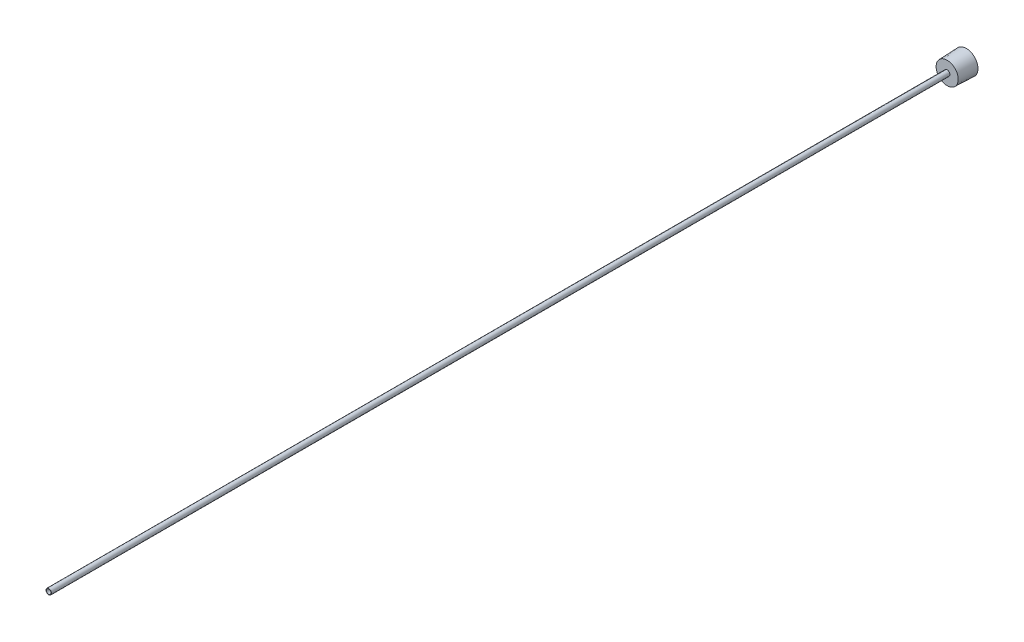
from build123d import *

# Parameters (mm, degrees)
SKETCH2_R          = 0.762
CUT_EXTRUDE1_DEPTH = 305.84986935
CUT_EXTRUDE2_DEPTH = 3.96875


with BuildPart() as part:
    # Sketch1 → Revolve1 (revolve)
    with BuildSketch(Plane(origin=(0, 0, 0), x_dir=(0, 0, -1), z_dir=(1, 0, 0)), mode=Mode.PRIVATE) as revolve1_sk:
        Polygon((-304.8, 0), (0, 0), (0, 3.8989), (-6.35, 3.667387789), (-6.35, 0.9144), (-304.8, 0.9144), align=None)
    revolve(revolve1_sk.sketch.rotate(Axis((0, 0, 0), (0, 0, -1)), 90), axis=Axis((0, 0, 0), (0, 0, -1)))

    # Sketch2 → Cut-Extrude1 (cut, through all)
    with BuildSketch(Plane.XY.offset(304.8)):
        Circle(SKETCH2_R)
    extrude(amount=-CUT_EXTRUDE1_DEPTH, mode=Mode.SUBTRACT)

    # Sketch3 → Cut-Extrude2 (cut)
    with BuildSketch(Plane(origin=(0, 0, 0), x_dir=(-1, 0, 0), z_dir=(0, 0, -1))):
        Polygon((0, -2.749630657), (2.38125, -1.374815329), (2.38125, 1.374815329), (0, 2.749630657), (-2.38125, 1.374815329), (-2.38125, -1.374815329), align=None)
    extrude(amount=-CUT_EXTRUDE2_DEPTH, mode=Mode.SUBTRACT)


solid = part.part
